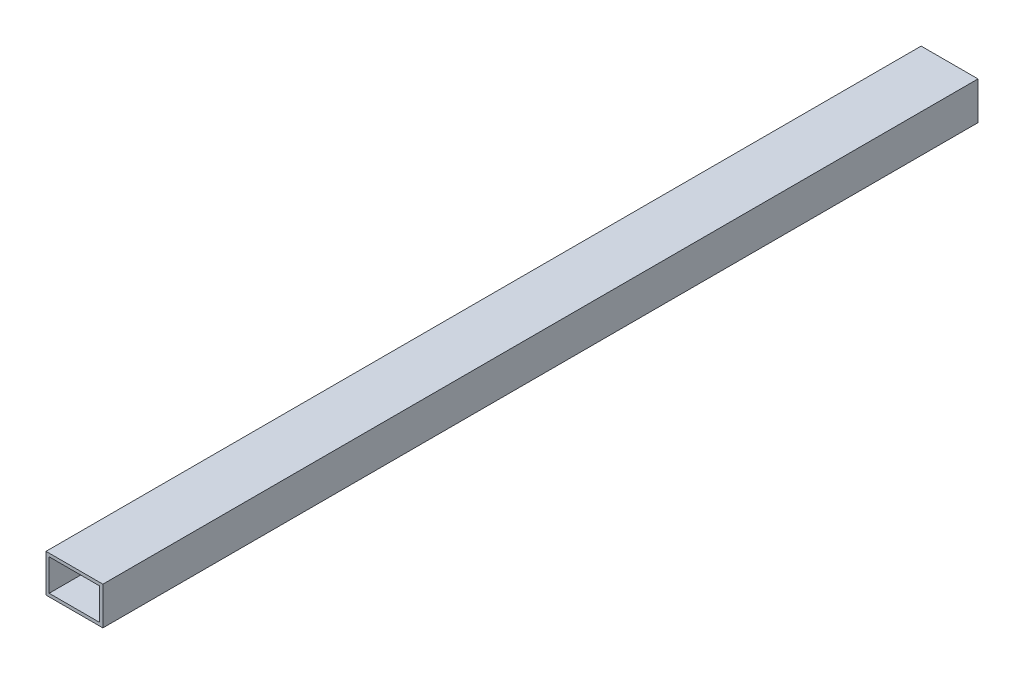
ISO-10303-21;
HEADER;
FILE_DESCRIPTION(('STEP AP214'),'2;1');
FILE_NAME('part.step','',(''),(''),'','','');
FILE_SCHEMA(('AUTOMOTIVE_DESIGN { 1 0 10303 214 1 1 1 1 }'));
ENDSEC;
DATA;
#1=APPLICATION_CONTEXT('core data for automotive mechanical design processes');
#2=APPLICATION_PROTOCOL_DEFINITION('international standard','automotive_design',2000,#1);
#3=PRODUCT_CONTEXT('',#1,'mechanical');
#4=PRODUCT('Part','Part','',(#3));
#5=PRODUCT_RELATED_PRODUCT_CATEGORY('part','',(#4));
#6=PRODUCT_DEFINITION_FORMATION('','',#4);
#7=PRODUCT_DEFINITION_CONTEXT('part definition',#1,'design');
#8=PRODUCT_DEFINITION('design','',#6,#7);
#9=PRODUCT_DEFINITION_SHAPE('','',#8);
#10=(LENGTH_UNIT() NAMED_UNIT(*) SI_UNIT(.MILLI.,.METRE.));
#11=(NAMED_UNIT(*) PLANE_ANGLE_UNIT() SI_UNIT($,.RADIAN.));
#12=(NAMED_UNIT(*) SI_UNIT($,.STERADIAN.) SOLID_ANGLE_UNIT());
#13=UNCERTAINTY_MEASURE_WITH_UNIT(LENGTH_MEASURE(1.E-05),#10,'distance_accuracy_value','');
#14=(GEOMETRIC_REPRESENTATION_CONTEXT(3) GLOBAL_UNCERTAINTY_ASSIGNED_CONTEXT((#13)) GLOBAL_UNIT_ASSIGNED_CONTEXT((#10,
#11,#12)) REPRESENTATION_CONTEXT('',''));
#15=CARTESIAN_POINT('',(0.,0.,0.));
#16=DIRECTION('',(0.,0.,1.));
#17=DIRECTION('',(1.,0.,0.));
#18=AXIS2_PLACEMENT_3D('',#15,#16,#17);
#19=CARTESIAN_POINT('',(0.,0.,0.));
#20=DIRECTION('',(0.,0.,-1.));
#21=DIRECTION('',(-1.,0.,0.));
#22=AXIS2_PLACEMENT_3D('',#19,#20,#21);
#23=PLANE('',#22);
#24=DIRECTION('',(0.,1.,0.));
#25=VECTOR('',#24,1.);
#26=CARTESIAN_POINT('',(-127.,-6.34999999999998,0.));
#27=LINE('',#26,#25);
#28=CARTESIAN_POINT('',(-127.,-82.55,0.));
#29=VERTEX_POINT('',#28);
#30=CARTESIAN_POINT('',(-127.,-6.34999999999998,0.));
#31=VERTEX_POINT('',#30);
#32=EDGE_CURVE('E134',#29,#31,#27,.T.);
#33=ORIENTED_EDGE('',*,*,#32,.F.);
#34=DIRECTION('',(1.,0.,0.));
#35=VECTOR('',#34,1.);
#36=CARTESIAN_POINT('',(-127.,-82.55,0.));
#37=LINE('',#36,#35);
#38=CARTESIAN_POINT('',(-241.3,-82.55,0.));
#39=VERTEX_POINT('',#38);
#40=EDGE_CURVE('E104',#39,#29,#37,.T.);
#41=ORIENTED_EDGE('',*,*,#40,.F.);
#42=DIRECTION('',(0.,-1.,0.));
#43=VECTOR('',#42,1.);
#44=CARTESIAN_POINT('',(-241.3,-6.34999999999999,0.));
#45=LINE('',#44,#43);
#46=CARTESIAN_POINT('',(-241.3,-6.34999999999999,0.));
#47=VERTEX_POINT('',#46);
#48=EDGE_CURVE('E128',#47,#39,#45,.T.);
#49=ORIENTED_EDGE('',*,*,#48,.F.);
#50=DIRECTION('',(-1.,0.,0.));
#51=VECTOR('',#50,1.);
#52=CARTESIAN_POINT('',(-127.,-6.34999999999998,0.));
#53=LINE('',#52,#51);
#54=EDGE_CURVE('E124',#31,#47,#53,.T.);
#55=ORIENTED_EDGE('',*,*,#54,.F.);
#56=EDGE_LOOP('',(#33,#41,#49,#55));
#57=FACE_BOUND('',#56,.T.);
#58=DIRECTION('',(1.,0.,0.));
#59=VECTOR('',#58,1.);
#60=CARTESIAN_POINT('',(-133.35,-76.2,0.));
#61=LINE('',#60,#59);
#62=CARTESIAN_POINT('',(-234.95,-76.2,0.));
#63=VERTEX_POINT('',#62);
#64=CARTESIAN_POINT('',(-133.35,-76.2,0.));
#65=VERTEX_POINT('',#64);
#66=EDGE_CURVE('E114',#63,#65,#61,.T.);
#67=ORIENTED_EDGE('',*,*,#66,.T.);
#68=DIRECTION('',(0.,1.,0.));
#69=VECTOR('',#68,1.);
#70=CARTESIAN_POINT('',(-133.35,-12.7,0.));
#71=LINE('',#70,#69);
#72=CARTESIAN_POINT('',(-133.35,-12.7,0.));
#73=VERTEX_POINT('',#72);
#74=EDGE_CURVE('E100',#65,#73,#71,.T.);
#75=ORIENTED_EDGE('',*,*,#74,.T.);
#76=DIRECTION('',(-1.,0.,0.));
#77=VECTOR('',#76,1.);
#78=CARTESIAN_POINT('',(-133.35,-12.7,0.));
#79=LINE('',#78,#77);
#80=CARTESIAN_POINT('',(-234.95,-12.7,0.));
#81=VERTEX_POINT('',#80);
#82=EDGE_CURVE('E107',#73,#81,#79,.T.);
#83=ORIENTED_EDGE('',*,*,#82,.T.);
#84=DIRECTION('',(0.,-1.,0.));
#85=VECTOR('',#84,1.);
#86=CARTESIAN_POINT('',(-234.95,-12.7,0.));
#87=LINE('',#86,#85);
#88=EDGE_CURVE('E111',#81,#63,#87,.T.);
#89=ORIENTED_EDGE('',*,*,#88,.T.);
#90=EDGE_LOOP('',(#67,#75,#83,#89));
#91=FACE_BOUND('',#90,.T.);
#92=ADVANCED_FACE('F35',(#57,#91),#23,.T.);
#93=CARTESIAN_POINT('',(-127.,-6.34999999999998,1896.32150359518));
#94=DIRECTION('',(-1.,0.,0.));
#95=DIRECTION('',(0.,0.,1.));
#96=AXIS2_PLACEMENT_3D('',#93,#94,#95);
#97=PLANE('',#96);
#98=DIRECTION('',(0.,0.,-1.));
#99=VECTOR('',#98,1.);
#100=CARTESIAN_POINT('',(-127.,-6.34999999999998,1896.32150359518));
#101=LINE('',#100,#99);
#102=CARTESIAN_POINT('',(-127.,-6.34999999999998,1758.95));
#103=VERTEX_POINT('',#102);
#104=EDGE_CURVE('E122',#103,#31,#101,.T.);
#105=ORIENTED_EDGE('',*,*,#104,.F.);
#106=DIRECTION('',(0.,-1.,0.));
#107=VECTOR('',#106,1.);
#108=CARTESIAN_POINT('',(-127.,-6.34999999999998,1758.95));
#109=LINE('',#108,#107);
#110=CARTESIAN_POINT('',(-127.,-82.55,1758.95));
#111=VERTEX_POINT('',#110);
#112=EDGE_CURVE('E52',#103,#111,#109,.T.);
#113=ORIENTED_EDGE('',*,*,#112,.T.);
#114=DIRECTION('',(0.,0.,-1.));
#115=VECTOR('',#114,1.);
#116=CARTESIAN_POINT('',(-127.,-82.55,1896.32150359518));
#117=LINE('',#116,#115);
#118=EDGE_CURVE('E133',#111,#29,#117,.T.);
#119=ORIENTED_EDGE('',*,*,#118,.T.);
#120=ORIENTED_EDGE('',*,*,#32,.T.);
#121=EDGE_LOOP('',(#105,#113,#119,#120));
#122=FACE_BOUND('',#121,.T.);
#123=ADVANCED_FACE('F182',(#122),#97,.F.);
#124=CARTESIAN_POINT('',(-127.,-6.34999999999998,1896.32150359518));
#125=DIRECTION('',(0.,-1.,0.));
#126=DIRECTION('',(1.,0.,0.));
#127=AXIS2_PLACEMENT_3D('',#124,#125,#126);
#128=PLANE('',#127);
#129=DIRECTION('',(0.,0.,-1.));
#130=VECTOR('',#129,1.);
#131=CARTESIAN_POINT('',(-241.3,-6.34999999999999,1896.32150359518));
#132=LINE('',#131,#130);
#133=CARTESIAN_POINT('',(-241.3,-6.34999999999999,1758.95));
#134=VERTEX_POINT('',#133);
#135=EDGE_CURVE('E126',#134,#47,#132,.T.);
#136=ORIENTED_EDGE('',*,*,#135,.F.);
#137=DIRECTION('',(1.,0.,0.));
#138=VECTOR('',#137,1.);
#139=CARTESIAN_POINT('',(-127.,-6.34999999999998,1758.95));
#140=LINE('',#139,#138);
#141=EDGE_CURVE('E125',#134,#103,#140,.T.);
#142=ORIENTED_EDGE('',*,*,#141,.T.);
#143=ORIENTED_EDGE('',*,*,#104,.T.);
#144=ORIENTED_EDGE('',*,*,#54,.T.);
#145=EDGE_LOOP('',(#136,#142,#143,#144));
#146=FACE_BOUND('',#145,.T.);
#147=ADVANCED_FACE('F162',(#146),#128,.F.);
#148=CARTESIAN_POINT('',(-241.3,-6.34999999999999,1896.32150359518));
#149=DIRECTION('',(1.,0.,0.));
#150=DIRECTION('',(0.,1.,0.));
#151=AXIS2_PLACEMENT_3D('',#148,#149,#150);
#152=PLANE('',#151);
#153=DIRECTION('',(0.,0.,-1.));
#154=VECTOR('',#153,1.);
#155=CARTESIAN_POINT('',(-241.3,-82.55,1896.32150359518));
#156=LINE('',#155,#154);
#157=CARTESIAN_POINT('',(-241.3,-82.55,1758.95));
#158=VERTEX_POINT('',#157);
#159=EDGE_CURVE('E130',#158,#39,#156,.T.);
#160=ORIENTED_EDGE('',*,*,#159,.F.);
#161=DIRECTION('',(0.,1.,0.));
#162=VECTOR('',#161,1.);
#163=CARTESIAN_POINT('',(-241.3,-6.34999999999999,1758.95));
#164=LINE('',#163,#162);
#165=EDGE_CURVE('E129',#158,#134,#164,.T.);
#166=ORIENTED_EDGE('',*,*,#165,.T.);
#167=ORIENTED_EDGE('',*,*,#135,.T.);
#168=ORIENTED_EDGE('',*,*,#48,.T.);
#169=EDGE_LOOP('',(#160,#166,#167,#168));
#170=FACE_BOUND('',#169,.T.);
#171=ADVANCED_FACE('F167',(#170),#152,.F.);
#172=CARTESIAN_POINT('',(-127.,-82.55,1896.32150359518));
#173=DIRECTION('',(0.,1.,0.));
#174=DIRECTION('',(-1.,0.,0.));
#175=AXIS2_PLACEMENT_3D('',#172,#173,#174);
#176=PLANE('',#175);
#177=ORIENTED_EDGE('',*,*,#118,.F.);
#178=DIRECTION('',(-1.,0.,0.));
#179=VECTOR('',#178,1.);
#180=CARTESIAN_POINT('',(-127.,-82.55,1758.95));
#181=LINE('',#180,#179);
#182=EDGE_CURVE('E132',#111,#158,#181,.T.);
#183=ORIENTED_EDGE('',*,*,#182,.T.);
#184=ORIENTED_EDGE('',*,*,#159,.T.);
#185=ORIENTED_EDGE('',*,*,#40,.T.);
#186=EDGE_LOOP('',(#177,#183,#184,#185));
#187=FACE_BOUND('',#186,.T.);
#188=ADVANCED_FACE('F173',(#187),#176,.F.);
#189=CARTESIAN_POINT('',(-133.35,-12.7,1896.32150359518));
#190=DIRECTION('',(-1.,0.,0.));
#191=DIRECTION('',(0.,0.,1.));
#192=AXIS2_PLACEMENT_3D('',#189,#190,#191);
#193=PLANE('',#192);
#194=DIRECTION('',(0.,-1.,0.));
#195=VECTOR('',#194,1.);
#196=CARTESIAN_POINT('',(-133.35,-12.7,1758.95));
#197=LINE('',#196,#195);
#198=CARTESIAN_POINT('',(-133.35,-12.7,1758.95));
#199=VERTEX_POINT('',#198);
#200=CARTESIAN_POINT('',(-133.35,-76.2,1758.95));
#201=VERTEX_POINT('',#200);
#202=EDGE_CURVE('E103',#199,#201,#197,.T.);
#203=ORIENTED_EDGE('',*,*,#202,.F.);
#204=DIRECTION('',(0.,0.,-1.));
#205=VECTOR('',#204,1.);
#206=CARTESIAN_POINT('',(-133.35,-12.7,1896.32150359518));
#207=LINE('',#206,#205);
#208=EDGE_CURVE('E96',#199,#73,#207,.T.);
#209=ORIENTED_EDGE('',*,*,#208,.T.);
#210=ORIENTED_EDGE('',*,*,#74,.F.);
#211=DIRECTION('',(0.,0.,-1.));
#212=VECTOR('',#211,1.);
#213=CARTESIAN_POINT('',(-133.35,-76.2,1896.32150359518));
#214=LINE('',#213,#212);
#215=EDGE_CURVE('E139',#201,#65,#214,.T.);
#216=ORIENTED_EDGE('',*,*,#215,.F.);
#217=EDGE_LOOP('',(#203,#209,#210,#216));
#218=FACE_BOUND('',#217,.T.);
#219=ADVANCED_FACE('F97',(#218),#193,.T.);
#220=CARTESIAN_POINT('',(-133.35,-12.7,1896.32150359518));
#221=DIRECTION('',(0.,-1.,0.));
#222=DIRECTION('',(1.,0.,0.));
#223=AXIS2_PLACEMENT_3D('',#220,#221,#222);
#224=PLANE('',#223);
#225=DIRECTION('',(1.,0.,0.));
#226=VECTOR('',#225,1.);
#227=CARTESIAN_POINT('',(-133.35,-12.7,1758.95));
#228=LINE('',#227,#226);
#229=CARTESIAN_POINT('',(-234.95,-12.7,1758.95));
#230=VERTEX_POINT('',#229);
#231=EDGE_CURVE('E11',#230,#199,#228,.T.);
#232=ORIENTED_EDGE('',*,*,#231,.F.);
#233=DIRECTION('',(0.,0.,-1.));
#234=VECTOR('',#233,1.);
#235=CARTESIAN_POINT('',(-234.95,-12.7,1896.32150359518));
#236=LINE('',#235,#234);
#237=EDGE_CURVE('E89',#230,#81,#236,.T.);
#238=ORIENTED_EDGE('',*,*,#237,.T.);
#239=ORIENTED_EDGE('',*,*,#82,.F.);
#240=ORIENTED_EDGE('',*,*,#208,.F.);
#241=EDGE_LOOP('',(#232,#238,#239,#240));
#242=FACE_BOUND('',#241,.T.);
#243=ADVANCED_FACE('F108',(#242),#224,.T.);
#244=CARTESIAN_POINT('',(-234.95,-12.7,1896.32150359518));
#245=DIRECTION('',(1.,0.,0.));
#246=DIRECTION('',(0.,0.,-1.));
#247=AXIS2_PLACEMENT_3D('',#244,#245,#246);
#248=PLANE('',#247);
#249=DIRECTION('',(0.,1.,0.));
#250=VECTOR('',#249,1.);
#251=CARTESIAN_POINT('',(-234.95,-12.7,1758.95));
#252=LINE('',#251,#250);
#253=CARTESIAN_POINT('',(-234.95,-76.2,1758.95));
#254=VERTEX_POINT('',#253);
#255=EDGE_CURVE('E39',#254,#230,#252,.T.);
#256=ORIENTED_EDGE('',*,*,#255,.F.);
#257=DIRECTION('',(0.,0.,-1.));
#258=VECTOR('',#257,1.);
#259=CARTESIAN_POINT('',(-234.95,-76.2,1896.32150359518));
#260=LINE('',#259,#258);
#261=EDGE_CURVE('E137',#254,#63,#260,.T.);
#262=ORIENTED_EDGE('',*,*,#261,.T.);
#263=ORIENTED_EDGE('',*,*,#88,.F.);
#264=ORIENTED_EDGE('',*,*,#237,.F.);
#265=EDGE_LOOP('',(#256,#262,#263,#264));
#266=FACE_BOUND('',#265,.T.);
#267=ADVANCED_FACE('F155',(#266),#248,.T.);
#268=CARTESIAN_POINT('',(-133.35,-76.2,1896.32150359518));
#269=DIRECTION('',(0.,1.,0.));
#270=DIRECTION('',(-1.,0.,0.));
#271=AXIS2_PLACEMENT_3D('',#268,#269,#270);
#272=PLANE('',#271);
#273=DIRECTION('',(-1.,0.,0.));
#274=VECTOR('',#273,1.);
#275=CARTESIAN_POINT('',(-133.35,-76.2,1758.95));
#276=LINE('',#275,#274);
#277=EDGE_CURVE('E119',#201,#254,#276,.T.);
#278=ORIENTED_EDGE('',*,*,#277,.F.);
#279=ORIENTED_EDGE('',*,*,#215,.T.);
#280=ORIENTED_EDGE('',*,*,#66,.F.);
#281=ORIENTED_EDGE('',*,*,#261,.F.);
#282=EDGE_LOOP('',(#278,#279,#280,#281));
#283=FACE_BOUND('',#282,.T.);
#284=ADVANCED_FACE('F152',(#283),#272,.T.);
#285=CARTESIAN_POINT('',(-1542.26280991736,-82.55,1758.95));
#286=DIRECTION('',(0.,0.,-1.));
#287=DIRECTION('',(0.,1.,0.));
#288=AXIS2_PLACEMENT_3D('',#285,#286,#287);
#289=PLANE('',#288);
#290=ORIENTED_EDGE('',*,*,#202,.T.);
#291=ORIENTED_EDGE('',*,*,#277,.T.);
#292=ORIENTED_EDGE('',*,*,#255,.T.);
#293=ORIENTED_EDGE('',*,*,#231,.T.);
#294=EDGE_LOOP('',(#290,#291,#292,#293));
#295=FACE_BOUND('',#294,.T.);
#296=ORIENTED_EDGE('',*,*,#141,.F.);
#297=ORIENTED_EDGE('',*,*,#165,.F.);
#298=ORIENTED_EDGE('',*,*,#182,.F.);
#299=ORIENTED_EDGE('',*,*,#112,.F.);
#300=EDGE_LOOP('',(#296,#297,#298,#299));
#301=FACE_BOUND('',#300,.T.);
#302=ADVANCED_FACE('F37',(#295,#301),#289,.F.);
#303=CLOSED_SHELL('',(#92,#123,#147,#171,#188,#219,#243,#267,#284,#302));
#304=MANIFOLD_SOLID_BREP('B2',#303);
#305=ADVANCED_BREP_SHAPE_REPRESENTATION('',(#18,#304),#14);
#306=SHAPE_DEFINITION_REPRESENTATION(#9,#305);
ENDSEC;
END-ISO-10303-21;
